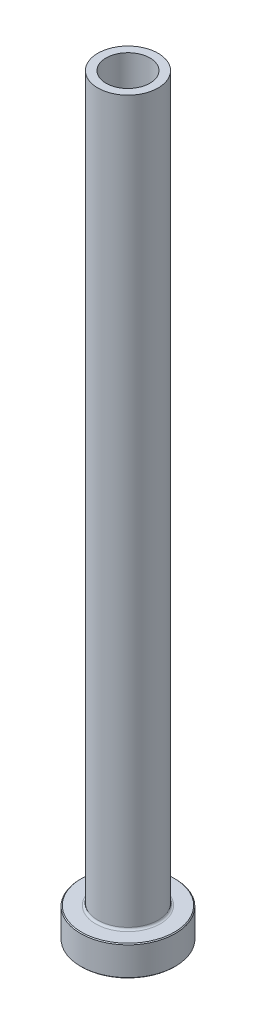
from build123d import *

# Parameters (mm, degrees)
FILLET1_R     = 0.5
CHAMFER1_SIZE = 0.2
CHAMFER3_SIZE = 0.5


with BuildPart() as part:
    # Sketch1 → Revolve1 (revolve)
    with BuildSketch(Plane.XY, mode=Mode.PRIVATE) as revolve1_sk:
        Polygon((-5.1, 175), (-7, 175), (-7, 7), (-11, 7), (-11, 0), (-5.35, 0), (-5.35, 108), (-5.1, 120), align=None)
    revolve(revolve1_sk.sketch.rotate(Axis((0, 92.187680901, 0), (0, -1, 0)), 270), axis=Axis((0, 92.187680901, 0), (0, -1, 0)))

    # Fillet1
    fillet1_edges = [part.edges().sort_by_distance(p)[0] for p in [
        (0, 7, -7),
    ]]
    fillet(fillet1_edges, radius=FILLET1_R)

    # Chamfer1
    chamfer1_edges = [part.edges().sort_by_distance(p)[0] for p in [
        (0, 0, -11),
        (0, 7, -11),
    ]]
    chamfer(chamfer1_edges, length=CHAMFER1_SIZE)

    # Chamfer3
    chamfer3_edges = [part.edges().sort_by_distance(p)[0] for p in [
        (0, 0, -5.35),
    ]]
    chamfer(chamfer3_edges, length=CHAMFER3_SIZE)


solid = part.part
